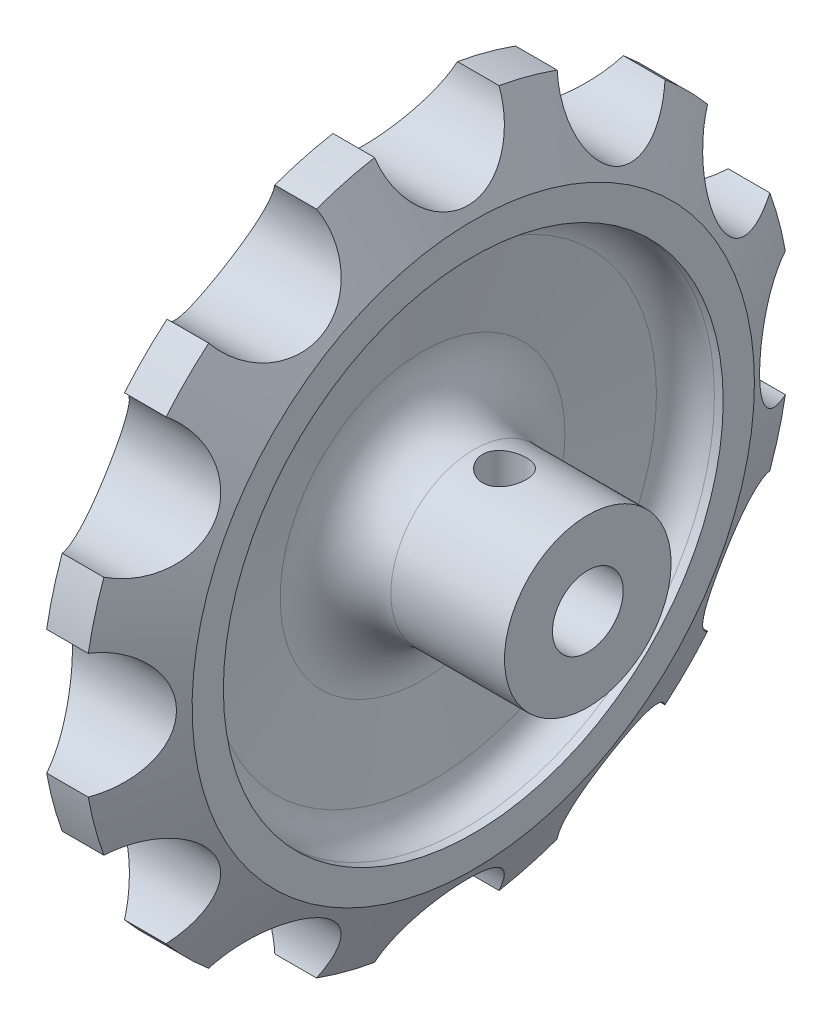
from build123d import *

# Parameters (mm, degrees)
EXTRUDE_START                   = -0.254033
SKETCH_12_R                     = 2
EXTRUDE_2_DEPTH                 = 0.254033
HOLE_WIZARD_M5_1_REACH          = 57.821
HOLE_WIZARD_M5_1_BORE_R         = 2.1
CUT_EXTRUDE_1_REACH             = 54.469
SKETCH_14_R                     = 6
CUT_EXTRUDE_1_DIRECTION_2_REACH = 54.469


with BuildPart() as part:
    # Sketch 1 → Revolve 1 (revolve)
    with BuildSketch(Plane.XY, mode=Mode.PRIVATE) as revolve_1_sk:
        with BuildLine():
            Line((0, 0), (0, 13))
            Line((0, 13), (1, 13))
            Line((1, 13), (2.035635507, 20.594660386))
            ThreePointArc((2.035635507, 20.594660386), (1.323235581, 22.97281286), (-0.936854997, 24))
            Line((-0.936854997, 24), (-1, 24))
            Line((-1, 24), (-1, 27))
            Line((-1, 27), (2.5, 34))
            Line((2.5, 34), (6.5, 34))
            Line((6.5, 34), (10, 27))
            Line((10, 27), (10, 24))
            Line((10, 24), (9.155691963, 24))
            ThreePointArc((9.155691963, 24), (7.182879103, 23.260090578), (6.183201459, 21.405339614))
            Line((6.183201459, 21.405339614), (5.129141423, 13.675566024))
            ThreePointArc((5.129141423, 13.675566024), (6.316474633, 9.711978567), (10.083292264, 8))
            Line((10.083292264, 8), (21, 8))
            Line((21, 8), (21, 0))
            Line((21, 0), (0, 0))
        make_face()
    revolve(revolve_1_sk.sketch.rotate(Axis((21, 0, 0), (-1, 0, 0)), 90), axis=Axis((21, 0, 0), (-1, 0, 0)))

    # Sketch 5 → Hole Wizard M8 _1 (revolve, cut)
    with BuildSketch(Plane(origin=(21, 0, 0), x_dir=(0, 0, -1), z_dir=(0, 1, 0))):
        Polygon((0, 0), (0, 17.042926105), (3.4, 15), (3.4, 0), align=None)
    revolve(axis=Axis((27.35, 0, 0), (-1, 0, 0)), mode=Mode.SUBTRACT)

    # Sketch 12 → Extrude 2 (add)
    with BuildSketch(Plane(origin=(0, 8, 0), x_dir=(-1, 0, 0), z_dir=(0, 1, 0)).offset(EXTRUDE_START)):
        with Locations((-13, 0)):
            Circle(SKETCH_12_R)
    extrude(amount=EXTRUDE_2_DEPTH)

    # Hole Wizard M5 _1 bore (on position points) → Hole Wizard M5 _1 (cut, up to next)
    with BuildSketch(Plane(origin=(13, 8, 0), x_dir=(0, 0, 1), z_dir=(0, 1, 0)), mode=Mode.PRIVATE) as hole_wizard_m5_1_sk1:
        Circle(HOLE_WIZARD_M5_1_BORE_R)
    hole_wizard_m5_1_tool1 = extrude(hole_wizard_m5_1_sk1.sketch, amount=-HOLE_WIZARD_M5_1_REACH, mode=Mode.PRIVATE) & part.part
    add(hole_wizard_m5_1_tool1.solids().sort_by_distance((13, 8, 0))[0], mode=Mode.SUBTRACT)

    # Sketch 14 → Cut-Extrude 1 (cut, up to next)
    with BuildSketch(Plane(origin=(0, 0, 0), x_dir=(0, 0, -1), z_dir=(1, 0, 0)), mode=Mode.PRIVATE) as cut_extrude_1_sk1:
        with Locations((0, -34)):
            Circle(SKETCH_14_R)
    cut_extrude_1_tool1 = extrude(cut_extrude_1_sk1.sketch, amount=-CUT_EXTRUDE_1_REACH, mode=Mode.PRIVATE) & part.part
    # Sketch 14 → Cut-Extrude 1 (cut, up to next)
    with BuildSketch(Plane(origin=(0, 0, 0), x_dir=(0, 0, -1), z_dir=(1, 0, 0)), mode=Mode.PRIVATE) as cut_extrude_1_sk2:
        with Locations((-17, -29.444863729)):
            Circle(SKETCH_14_R)
    cut_extrude_1_tool2 = extrude(cut_extrude_1_sk2.sketch, amount=-CUT_EXTRUDE_1_REACH, mode=Mode.PRIVATE) & part.part
    # Sketch 14 → Cut-Extrude 1 (cut, up to next)
    with BuildSketch(Plane(origin=(0, 0, 0), x_dir=(0, 0, -1), z_dir=(1, 0, 0)), mode=Mode.PRIVATE) as cut_extrude_1_sk3:
        with Locations((-29.444863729, -17)):
            Circle(SKETCH_14_R)
    cut_extrude_1_tool3 = extrude(cut_extrude_1_sk3.sketch, amount=-CUT_EXTRUDE_1_REACH, mode=Mode.PRIVATE) & part.part
    # Sketch 14 → Cut-Extrude 1 (cut, up to next)
    with BuildSketch(Plane(origin=(0, 0, 0), x_dir=(0, 0, -1), z_dir=(1, 0, 0)), mode=Mode.PRIVATE) as cut_extrude_1_sk4:
        with Locations((-34, 0)):
            Circle(SKETCH_14_R)
    cut_extrude_1_tool4 = extrude(cut_extrude_1_sk4.sketch, amount=-CUT_EXTRUDE_1_REACH, mode=Mode.PRIVATE) & part.part
    # Sketch 14 → Cut-Extrude 1 (cut, up to next)
    with BuildSketch(Plane(origin=(0, 0, 0), x_dir=(0, 0, -1), z_dir=(1, 0, 0)), mode=Mode.PRIVATE) as cut_extrude_1_sk5:
        with Locations((-29.444863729, 17)):
            Circle(SKETCH_14_R)
    cut_extrude_1_tool5 = extrude(cut_extrude_1_sk5.sketch, amount=-CUT_EXTRUDE_1_REACH, mode=Mode.PRIVATE) & part.part
    # Sketch 14 → Cut-Extrude 1 (cut, up to next)
    with BuildSketch(Plane(origin=(0, 0, 0), x_dir=(0, 0, -1), z_dir=(1, 0, 0)), mode=Mode.PRIVATE) as cut_extrude_1_sk6:
        with Locations((-17, 29.444863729)):
            Circle(SKETCH_14_R)
    cut_extrude_1_tool6 = extrude(cut_extrude_1_sk6.sketch, amount=-CUT_EXTRUDE_1_REACH, mode=Mode.PRIVATE) & part.part
    # Sketch 14 → Cut-Extrude 1 (cut, up to next)
    with BuildSketch(Plane(origin=(0, 0, 0), x_dir=(0, 0, -1), z_dir=(1, 0, 0)), mode=Mode.PRIVATE) as cut_extrude_1_sk7:
        with Locations((0, 34)):
            Circle(SKETCH_14_R)
    cut_extrude_1_tool7 = extrude(cut_extrude_1_sk7.sketch, amount=-CUT_EXTRUDE_1_REACH, mode=Mode.PRIVATE) & part.part
    # Sketch 14 → Cut-Extrude 1 (cut, up to next)
    with BuildSketch(Plane(origin=(0, 0, 0), x_dir=(0, 0, -1), z_dir=(1, 0, 0)), mode=Mode.PRIVATE) as cut_extrude_1_sk8:
        with Locations((17, 29.444863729)):
            Circle(SKETCH_14_R)
    cut_extrude_1_tool8 = extrude(cut_extrude_1_sk8.sketch, amount=-CUT_EXTRUDE_1_REACH, mode=Mode.PRIVATE) & part.part
    # Sketch 14 → Cut-Extrude 1 (cut, up to next)
    with BuildSketch(Plane(origin=(0, 0, 0), x_dir=(0, 0, -1), z_dir=(1, 0, 0)), mode=Mode.PRIVATE) as cut_extrude_1_sk9:
        with Locations((29.444863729, 17)):
            Circle(SKETCH_14_R)
    cut_extrude_1_tool9 = extrude(cut_extrude_1_sk9.sketch, amount=-CUT_EXTRUDE_1_REACH, mode=Mode.PRIVATE) & part.part
    # Sketch 14 → Cut-Extrude 1 (cut, up to next)
    with BuildSketch(Plane(origin=(0, 0, 0), x_dir=(0, 0, -1), z_dir=(1, 0, 0)), mode=Mode.PRIVATE) as cut_extrude_1_sk10:
        with Locations((34, 0)):
            Circle(SKETCH_14_R)
    cut_extrude_1_tool10 = extrude(cut_extrude_1_sk10.sketch, amount=-CUT_EXTRUDE_1_REACH, mode=Mode.PRIVATE) & part.part
    # Sketch 14 → Cut-Extrude 1 (cut, up to next)
    with BuildSketch(Plane(origin=(0, 0, 0), x_dir=(0, 0, -1), z_dir=(1, 0, 0)), mode=Mode.PRIVATE) as cut_extrude_1_sk11:
        with Locations((29.444863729, -17)):
            Circle(SKETCH_14_R)
    cut_extrude_1_tool11 = extrude(cut_extrude_1_sk11.sketch, amount=-CUT_EXTRUDE_1_REACH, mode=Mode.PRIVATE) & part.part
    # Sketch 14 → Cut-Extrude 1 (cut, up to next)
    with BuildSketch(Plane(origin=(0, 0, 0), x_dir=(0, 0, -1), z_dir=(1, 0, 0)), mode=Mode.PRIVATE) as cut_extrude_1_sk12:
        with Locations((17, -29.444863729)):
            Circle(SKETCH_14_R)
    cut_extrude_1_tool12 = extrude(cut_extrude_1_sk12.sketch, amount=-CUT_EXTRUDE_1_REACH, mode=Mode.PRIVATE) & part.part
    add(cut_extrude_1_tool1.solids().sort_by_distance((0, -34, 0))[0], mode=Mode.SUBTRACT)
    add(cut_extrude_1_tool2.solids().sort_by_distance((0, -29.444864, 17))[0], mode=Mode.SUBTRACT)
    add(cut_extrude_1_tool3.solids().sort_by_distance((0, -17, 29.444864))[0], mode=Mode.SUBTRACT)
    add(cut_extrude_1_tool4.solids().sort_by_distance((0, 0, 34))[0], mode=Mode.SUBTRACT)
    add(cut_extrude_1_tool5.solids().sort_by_distance((0, 17, 29.444864))[0], mode=Mode.SUBTRACT)
    add(cut_extrude_1_tool6.solids().sort_by_distance((0, 29.444864, 17))[0], mode=Mode.SUBTRACT)
    add(cut_extrude_1_tool7.solids().sort_by_distance((0, 34, 0))[0], mode=Mode.SUBTRACT)
    add(cut_extrude_1_tool8.solids().sort_by_distance((0, 29.444864, -17))[0], mode=Mode.SUBTRACT)
    add(cut_extrude_1_tool9.solids().sort_by_distance((0, 17, -29.444864))[0], mode=Mode.SUBTRACT)
    add(cut_extrude_1_tool10.solids().sort_by_distance((0, 0, -34))[0], mode=Mode.SUBTRACT)
    add(cut_extrude_1_tool11.solids().sort_by_distance((0, -17, -29.444864))[0], mode=Mode.SUBTRACT)
    add(cut_extrude_1_tool12.solids().sort_by_distance((0, -29.444864, -17))[0], mode=Mode.SUBTRACT)

    # Sketch 14 → Cut-Extrude 1 direction 2 (cut, up to next)
    with BuildSketch(Plane(origin=(0, 0, 0), x_dir=(0, 0, -1), z_dir=(1, 0, 0)), mode=Mode.PRIVATE) as cut_extrude_1_direction_2_sk1:
        with Locations((0, -34)):
            Circle(SKETCH_14_R)
    cut_extrude_1_direction_2_tool1 = extrude(cut_extrude_1_direction_2_sk1.sketch, amount=CUT_EXTRUDE_1_DIRECTION_2_REACH, mode=Mode.PRIVATE) & part.part
    # Sketch 14 → Cut-Extrude 1 direction 2 (cut, up to next)
    with BuildSketch(Plane(origin=(0, 0, 0), x_dir=(0, 0, -1), z_dir=(1, 0, 0)), mode=Mode.PRIVATE) as cut_extrude_1_direction_2_sk2:
        with Locations((-17, -29.444863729)):
            Circle(SKETCH_14_R)
    cut_extrude_1_direction_2_tool2 = extrude(cut_extrude_1_direction_2_sk2.sketch, amount=CUT_EXTRUDE_1_DIRECTION_2_REACH, mode=Mode.PRIVATE) & part.part
    # Sketch 14 → Cut-Extrude 1 direction 2 (cut, up to next)
    with BuildSketch(Plane(origin=(0, 0, 0), x_dir=(0, 0, -1), z_dir=(1, 0, 0)), mode=Mode.PRIVATE) as cut_extrude_1_direction_2_sk3:
        with Locations((-29.444863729, -17)):
            Circle(SKETCH_14_R)
    cut_extrude_1_direction_2_tool3 = extrude(cut_extrude_1_direction_2_sk3.sketch, amount=CUT_EXTRUDE_1_DIRECTION_2_REACH, mode=Mode.PRIVATE) & part.part
    # Sketch 14 → Cut-Extrude 1 direction 2 (cut, up to next)
    with BuildSketch(Plane(origin=(0, 0, 0), x_dir=(0, 0, -1), z_dir=(1, 0, 0)), mode=Mode.PRIVATE) as cut_extrude_1_direction_2_sk4:
        with Locations((-34, 0)):
            Circle(SKETCH_14_R)
    cut_extrude_1_direction_2_tool4 = extrude(cut_extrude_1_direction_2_sk4.sketch, amount=CUT_EXTRUDE_1_DIRECTION_2_REACH, mode=Mode.PRIVATE) & part.part
    # Sketch 14 → Cut-Extrude 1 direction 2 (cut, up to next)
    with BuildSketch(Plane(origin=(0, 0, 0), x_dir=(0, 0, -1), z_dir=(1, 0, 0)), mode=Mode.PRIVATE) as cut_extrude_1_direction_2_sk5:
        with Locations((-29.444863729, 17)):
            Circle(SKETCH_14_R)
    cut_extrude_1_direction_2_tool5 = extrude(cut_extrude_1_direction_2_sk5.sketch, amount=CUT_EXTRUDE_1_DIRECTION_2_REACH, mode=Mode.PRIVATE) & part.part
    # Sketch 14 → Cut-Extrude 1 direction 2 (cut, up to next)
    with BuildSketch(Plane(origin=(0, 0, 0), x_dir=(0, 0, -1), z_dir=(1, 0, 0)), mode=Mode.PRIVATE) as cut_extrude_1_direction_2_sk6:
        with Locations((-17, 29.444863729)):
            Circle(SKETCH_14_R)
    cut_extrude_1_direction_2_tool6 = extrude(cut_extrude_1_direction_2_sk6.sketch, amount=CUT_EXTRUDE_1_DIRECTION_2_REACH, mode=Mode.PRIVATE) & part.part
    # Sketch 14 → Cut-Extrude 1 direction 2 (cut, up to next)
    with BuildSketch(Plane(origin=(0, 0, 0), x_dir=(0, 0, -1), z_dir=(1, 0, 0)), mode=Mode.PRIVATE) as cut_extrude_1_direction_2_sk7:
        with Locations((0, 34)):
            Circle(SKETCH_14_R)
    cut_extrude_1_direction_2_tool7 = extrude(cut_extrude_1_direction_2_sk7.sketch, amount=CUT_EXTRUDE_1_DIRECTION_2_REACH, mode=Mode.PRIVATE) & part.part
    # Sketch 14 → Cut-Extrude 1 direction 2 (cut, up to next)
    with BuildSketch(Plane(origin=(0, 0, 0), x_dir=(0, 0, -1), z_dir=(1, 0, 0)), mode=Mode.PRIVATE) as cut_extrude_1_direction_2_sk8:
        with Locations((17, 29.444863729)):
            Circle(SKETCH_14_R)
    cut_extrude_1_direction_2_tool8 = extrude(cut_extrude_1_direction_2_sk8.sketch, amount=CUT_EXTRUDE_1_DIRECTION_2_REACH, mode=Mode.PRIVATE) & part.part
    # Sketch 14 → Cut-Extrude 1 direction 2 (cut, up to next)
    with BuildSketch(Plane(origin=(0, 0, 0), x_dir=(0, 0, -1), z_dir=(1, 0, 0)), mode=Mode.PRIVATE) as cut_extrude_1_direction_2_sk9:
        with Locations((29.444863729, 17)):
            Circle(SKETCH_14_R)
    cut_extrude_1_direction_2_tool9 = extrude(cut_extrude_1_direction_2_sk9.sketch, amount=CUT_EXTRUDE_1_DIRECTION_2_REACH, mode=Mode.PRIVATE) & part.part
    # Sketch 14 → Cut-Extrude 1 direction 2 (cut, up to next)
    with BuildSketch(Plane(origin=(0, 0, 0), x_dir=(0, 0, -1), z_dir=(1, 0, 0)), mode=Mode.PRIVATE) as cut_extrude_1_direction_2_sk10:
        with Locations((34, 0)):
            Circle(SKETCH_14_R)
    cut_extrude_1_direction_2_tool10 = extrude(cut_extrude_1_direction_2_sk10.sketch, amount=CUT_EXTRUDE_1_DIRECTION_2_REACH, mode=Mode.PRIVATE) & part.part
    # Sketch 14 → Cut-Extrude 1 direction 2 (cut, up to next)
    with BuildSketch(Plane(origin=(0, 0, 0), x_dir=(0, 0, -1), z_dir=(1, 0, 0)), mode=Mode.PRIVATE) as cut_extrude_1_direction_2_sk11:
        with Locations((29.444863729, -17)):
            Circle(SKETCH_14_R)
    cut_extrude_1_direction_2_tool11 = extrude(cut_extrude_1_direction_2_sk11.sketch, amount=CUT_EXTRUDE_1_DIRECTION_2_REACH, mode=Mode.PRIVATE) & part.part
    # Sketch 14 → Cut-Extrude 1 direction 2 (cut, up to next)
    with BuildSketch(Plane(origin=(0, 0, 0), x_dir=(0, 0, -1), z_dir=(1, 0, 0)), mode=Mode.PRIVATE) as cut_extrude_1_direction_2_sk12:
        with Locations((17, -29.444863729)):
            Circle(SKETCH_14_R)
    cut_extrude_1_direction_2_tool12 = extrude(cut_extrude_1_direction_2_sk12.sketch, amount=CUT_EXTRUDE_1_DIRECTION_2_REACH, mode=Mode.PRIVATE) & part.part
    add(cut_extrude_1_direction_2_tool1.solids().sort_by_distance((0, -34, 0))[0], mode=Mode.SUBTRACT)
    add(cut_extrude_1_direction_2_tool2.solids().sort_by_distance((0, -29.444864, 17))[0], mode=Mode.SUBTRACT)
    add(cut_extrude_1_direction_2_tool3.solids().sort_by_distance((0, -17, 29.444864))[0], mode=Mode.SUBTRACT)
    add(cut_extrude_1_direction_2_tool4.solids().sort_by_distance((0, 0, 34))[0], mode=Mode.SUBTRACT)
    add(cut_extrude_1_direction_2_tool5.solids().sort_by_distance((0, 17, 29.444864))[0], mode=Mode.SUBTRACT)
    add(cut_extrude_1_direction_2_tool6.solids().sort_by_distance((0, 29.444864, 17))[0], mode=Mode.SUBTRACT)
    add(cut_extrude_1_direction_2_tool7.solids().sort_by_distance((0, 34, 0))[0], mode=Mode.SUBTRACT)
    add(cut_extrude_1_direction_2_tool8.solids().sort_by_distance((0, 29.444864, -17))[0], mode=Mode.SUBTRACT)
    add(cut_extrude_1_direction_2_tool9.solids().sort_by_distance((0, 17, -29.444864))[0], mode=Mode.SUBTRACT)
    add(cut_extrude_1_direction_2_tool10.solids().sort_by_distance((0, 0, -34))[0], mode=Mode.SUBTRACT)
    add(cut_extrude_1_direction_2_tool11.solids().sort_by_distance((0, -17, -29.444864))[0], mode=Mode.SUBTRACT)
    add(cut_extrude_1_direction_2_tool12.solids().sort_by_distance((0, -29.444864, -17))[0], mode=Mode.SUBTRACT)


solid = part.part
